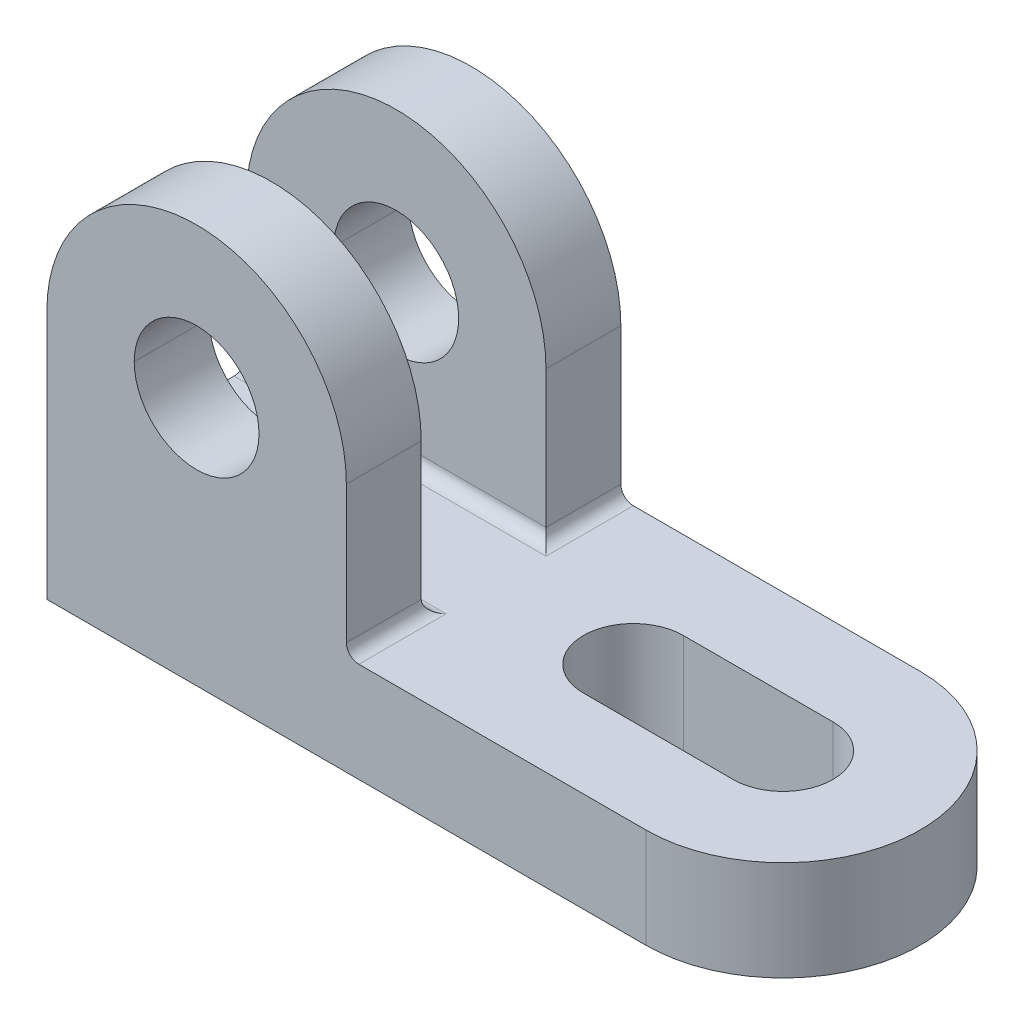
ISO-10303-21;
HEADER;
FILE_DESCRIPTION(('STEP AP214'),'2;1');
FILE_NAME('part.step','',(''),(''),'','','');
FILE_SCHEMA(('AUTOMOTIVE_DESIGN { 1 0 10303 214 1 1 1 1 }'));
ENDSEC;
DATA;
#1=APPLICATION_CONTEXT('core data for automotive mechanical design processes');
#2=APPLICATION_PROTOCOL_DEFINITION('international standard','automotive_design',2000,#1);
#3=PRODUCT_CONTEXT('',#1,'mechanical');
#4=PRODUCT('Part','Part','',(#3));
#5=PRODUCT_RELATED_PRODUCT_CATEGORY('part','',(#4));
#6=PRODUCT_DEFINITION_FORMATION('','',#4);
#7=PRODUCT_DEFINITION_CONTEXT('part definition',#1,'design');
#8=PRODUCT_DEFINITION('design','',#6,#7);
#9=PRODUCT_DEFINITION_SHAPE('','',#8);
#10=(LENGTH_UNIT() NAMED_UNIT(*) SI_UNIT(.MILLI.,.METRE.));
#11=(NAMED_UNIT(*) PLANE_ANGLE_UNIT() SI_UNIT($,.RADIAN.));
#12=(NAMED_UNIT(*) SI_UNIT($,.STERADIAN.) SOLID_ANGLE_UNIT());
#13=UNCERTAINTY_MEASURE_WITH_UNIT(LENGTH_MEASURE(1.E-05),#10,'distance_accuracy_value','');
#14=(GEOMETRIC_REPRESENTATION_CONTEXT(3) GLOBAL_UNCERTAINTY_ASSIGNED_CONTEXT((#13)) GLOBAL_UNIT_ASSIGNED_CONTEXT((#10,
#11,#12)) REPRESENTATION_CONTEXT('',''));
#15=CARTESIAN_POINT('',(0.,0.,0.));
#16=DIRECTION('',(0.,0.,1.));
#17=DIRECTION('',(1.,0.,0.));
#18=AXIS2_PLACEMENT_3D('',#15,#16,#17);
#19=CARTESIAN_POINT('',(-9.,18.,-10.));
#20=DIRECTION('',(0.,0.,-1.));
#21=DIRECTION('',(-1.,0.,0.));
#22=AXIS2_PLACEMENT_3D('',#19,#20,#21);
#23=CYLINDRICAL_SURFACE('',#22,2.);
#24=CARTESIAN_POINT('',(-11.,18.,-10.));
#25=CARTESIAN_POINT('',(-11.,16.8284271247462,-10.));
#26=CARTESIAN_POINT('',(-10.1715728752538,16.,-9.17157287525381));
#27=CARTESIAN_POINT('',(-9.,16.,-8.));
#28=(BOUNDED_CURVE() B_SPLINE_CURVE(3,(#24,#25,#26,#27),.UNSPECIFIED.,.F.,
.F.) B_SPLINE_CURVE_WITH_KNOTS((4,4),(0.,1.5707963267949),
.UNSPECIFIED.) CURVE() GEOMETRIC_REPRESENTATION_ITEM() RATIONAL_B_SPLINE_CURVE((1.,
0.804737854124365,0.804737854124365,1.)) REPRESENTATION_ITEM(''));
#29=CARTESIAN_POINT('',(-11.,18.,-10.));
#30=VERTEX_POINT('',#29);
#31=CARTESIAN_POINT('',(-9.,16.,-8.));
#32=VERTEX_POINT('',#31);
#33=EDGE_CURVE('E9',#30,#32,#28,.T.);
#34=ORIENTED_EDGE('',*,*,#33,.T.);
#35=DIRECTION('',(0.,0.,1.));
#36=VECTOR('',#35,1.);
#37=CARTESIAN_POINT('',(-9.,16.,0.));
#38=LINE('',#37,#36);
#39=CARTESIAN_POINT('',(-9.,16.,-22.));
#40=VERTEX_POINT('',#39);
#41=EDGE_CURVE('E244',#40,#32,#38,.T.);
#42=ORIENTED_EDGE('',*,*,#41,.F.);
#43=CARTESIAN_POINT('',(-9.,18.,-22.));
#44=DIRECTION('',(0.,0.,1.));
#45=DIRECTION('',(-1.,0.,0.));
#46=AXIS2_PLACEMENT_3D('',#43,#44,#45);
#47=CIRCLE('',#46,2.);
#48=CARTESIAN_POINT('',(-11.,18.,-22.));
#49=VERTEX_POINT('',#48);
#50=EDGE_CURVE('E420',#49,#40,#47,.T.);
#51=ORIENTED_EDGE('',*,*,#50,.F.);
#52=DIRECTION('',(0.,0.,-1.));
#53=VECTOR('',#52,1.);
#54=CARTESIAN_POINT('',(-11.,18.,-10.));
#55=LINE('',#54,#53);
#56=EDGE_CURVE('E291',#30,#49,#55,.T.);
#57=ORIENTED_EDGE('',*,*,#56,.F.);
#58=EDGE_LOOP('',(#34,#42,#51,#57));
#59=FACE_BOUND('',#58,.T.);
#60=ADVANCED_FACE('F15',(#59),#23,.F.);
#61=CARTESIAN_POINT('',(0.,18.,-8.));
#62=DIRECTION('',(-1.,0.,0.));
#63=DIRECTION('',(0.,0.,1.));
#64=AXIS2_PLACEMENT_3D('',#61,#62,#63);
#65=CYLINDRICAL_SURFACE('',#64,2.);
#66=CARTESIAN_POINT('',(-59.,18.,-8.));
#67=DIRECTION('',(1.,0.,0.));
#68=DIRECTION('',(0.,0.,-1.));
#69=AXIS2_PLACEMENT_3D('',#66,#67,#68);
#70=CIRCLE('',#69,2.);
#71=CARTESIAN_POINT('',(-59.,16.,-8.));
#72=VERTEX_POINT('',#71);
#73=CARTESIAN_POINT('',(-59.,18.,-10.));
#74=VERTEX_POINT('',#73);
#75=EDGE_CURVE('E229',#72,#74,#70,.T.);
#76=ORIENTED_EDGE('',*,*,#75,.F.);
#77=DIRECTION('',(-1.,0.,0.));
#78=VECTOR('',#77,1.);
#79=CARTESIAN_POINT('',(0.,16.,-8.));
#80=LINE('',#79,#78);
#81=EDGE_CURVE('E250',#32,#72,#80,.T.);
#82=ORIENTED_EDGE('',*,*,#81,.F.);
#83=ORIENTED_EDGE('',*,*,#33,.F.);
#84=DIRECTION('',(1.,0.,0.));
#85=VECTOR('',#84,1.);
#86=CARTESIAN_POINT('',(0.,18.,-10.));
#87=LINE('',#86,#85);
#88=EDGE_CURVE('E200',#74,#30,#87,.T.);
#89=ORIENTED_EDGE('',*,*,#88,.F.);
#90=EDGE_LOOP('',(#76,#82,#83,#89));
#91=FACE_BOUND('',#90,.T.);
#92=ADVANCED_FACE('F446',(#91),#65,.F.);
#93=CARTESIAN_POINT('',(-9.,18.,0.));
#94=DIRECTION('',(0.,0.,-1.));
#95=DIRECTION('',(-1.,0.,0.));
#96=AXIS2_PLACEMENT_3D('',#93,#94,#95);
#97=CYLINDRICAL_SURFACE('',#96,2.);
#98=CARTESIAN_POINT('',(-9.,16.,8.));
#99=CARTESIAN_POINT('',(-10.1715728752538,16.,9.17157287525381));
#100=CARTESIAN_POINT('',(-11.,16.8284271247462,10.));
#101=CARTESIAN_POINT('',(-11.,18.,10.));
#102=(BOUNDED_CURVE() B_SPLINE_CURVE(3,(#98,#99,#100,#101),.UNSPECIFIED.,.F.,
.F.) B_SPLINE_CURVE_WITH_KNOTS((4,4),(4.71238898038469,6.28318530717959),
.UNSPECIFIED.) CURVE() GEOMETRIC_REPRESENTATION_ITEM() RATIONAL_B_SPLINE_CURVE((1.,
0.804737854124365,0.804737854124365,1.)) REPRESENTATION_ITEM(''));
#103=CARTESIAN_POINT('',(-9.,16.,8.));
#104=VERTEX_POINT('',#103);
#105=CARTESIAN_POINT('',(-11.,18.,10.));
#106=VERTEX_POINT('',#105);
#107=EDGE_CURVE('E27',#104,#106,#102,.T.);
#108=ORIENTED_EDGE('',*,*,#107,.T.);
#109=DIRECTION('',(0.,0.,-1.));
#110=VECTOR('',#109,1.);
#111=CARTESIAN_POINT('',(-11.,18.,10.));
#112=LINE('',#111,#110);
#113=CARTESIAN_POINT('',(-11.,18.,22.));
#114=VERTEX_POINT('',#113);
#115=EDGE_CURVE('E188',#114,#106,#112,.T.);
#116=ORIENTED_EDGE('',*,*,#115,.F.);
#117=CARTESIAN_POINT('',(-9.,18.,22.));
#118=DIRECTION('',(0.,0.,-1.));
#119=DIRECTION('',(-1.,0.,0.));
#120=AXIS2_PLACEMENT_3D('',#117,#118,#119);
#121=CIRCLE('',#120,2.);
#122=CARTESIAN_POINT('',(-9.,16.,22.));
#123=VERTEX_POINT('',#122);
#124=EDGE_CURVE('E373',#123,#114,#121,.T.);
#125=ORIENTED_EDGE('',*,*,#124,.F.);
#126=DIRECTION('',(0.,0.,1.));
#127=VECTOR('',#126,1.);
#128=CARTESIAN_POINT('',(-9.,16.,22.));
#129=LINE('',#128,#127);
#130=EDGE_CURVE('E193',#104,#123,#129,.T.);
#131=ORIENTED_EDGE('',*,*,#130,.F.);
#132=EDGE_LOOP('',(#108,#116,#125,#131));
#133=FACE_BOUND('',#132,.T.);
#134=ADVANCED_FACE('F189',(#133),#97,.F.);
#135=CARTESIAN_POINT('',(0.,18.,8.));
#136=DIRECTION('',(-1.,0.,0.));
#137=DIRECTION('',(0.,0.,1.));
#138=AXIS2_PLACEMENT_3D('',#135,#136,#137);
#139=CYLINDRICAL_SURFACE('',#138,2.);
#140=CARTESIAN_POINT('',(-59.,18.,8.));
#141=DIRECTION('',(1.,0.,0.));
#142=DIRECTION('',(0.,0.,-1.));
#143=AXIS2_PLACEMENT_3D('',#140,#141,#142);
#144=CIRCLE('',#143,2.);
#145=CARTESIAN_POINT('',(-59.,18.,10.));
#146=VERTEX_POINT('',#145);
#147=CARTESIAN_POINT('',(-59.,16.,8.));
#148=VERTEX_POINT('',#147);
#149=EDGE_CURVE('E205',#146,#148,#144,.T.);
#150=ORIENTED_EDGE('',*,*,#149,.F.);
#151=DIRECTION('',(-1.,0.,0.));
#152=VECTOR('',#151,1.);
#153=CARTESIAN_POINT('',(0.,18.,10.));
#154=LINE('',#153,#152);
#155=EDGE_CURVE('E196',#106,#146,#154,.T.);
#156=ORIENTED_EDGE('',*,*,#155,.F.);
#157=ORIENTED_EDGE('',*,*,#107,.F.);
#158=DIRECTION('',(1.,0.,0.));
#159=VECTOR('',#158,1.);
#160=CARTESIAN_POINT('',(0.,16.,8.));
#161=LINE('',#160,#159);
#162=EDGE_CURVE('E235',#148,#104,#161,.T.);
#163=ORIENTED_EDGE('',*,*,#162,.F.);
#164=EDGE_LOOP('',(#150,#156,#157,#163));
#165=FACE_BOUND('',#164,.T.);
#166=ADVANCED_FACE('F198',(#165),#139,.F.);
#167=CARTESIAN_POINT('',(0.,0.,-10.));
#168=DIRECTION('',(0.,0.,-1.));
#169=DIRECTION('',(0.,-1.,0.));
#170=AXIS2_PLACEMENT_3D('',#167,#168,#169);
#171=PLANE('',#170);
#172=CARTESIAN_POINT('',(-35.,40.,-10.));
#173=DIRECTION('',(0.,0.,1.));
#174=DIRECTION('',(1.,0.,0.));
#175=AXIS2_PLACEMENT_3D('',#172,#173,#174);
#176=CIRCLE('',#175,10.);
#177=CARTESIAN_POINT('',(-45.,40.,-10.));
#178=VERTEX_POINT('',#177);
#179=CARTESIAN_POINT('',(-25.,40.,-10.));
#180=VERTEX_POINT('',#179);
#181=EDGE_CURVE('E329',#178,#180,#176,.T.);
#182=ORIENTED_EDGE('',*,*,#181,.F.);
#183=CARTESIAN_POINT('',(-35.,40.,-10.));
#184=DIRECTION('',(0.,0.,1.));
#185=DIRECTION('',(1.,0.,0.));
#186=AXIS2_PLACEMENT_3D('',#183,#184,#185);
#187=CIRCLE('',#186,10.);
#188=EDGE_CURVE('E296',#180,#178,#187,.T.);
#189=ORIENTED_EDGE('',*,*,#188,.F.);
#190=EDGE_LOOP('',(#182,#189));
#191=FACE_BOUND('',#190,.T.);
#192=DIRECTION('',(0.,1.,0.));
#193=VECTOR('',#192,1.);
#194=CARTESIAN_POINT('',(-59.,0.,-10.));
#195=LINE('',#194,#193);
#196=CARTESIAN_POINT('',(-59.,40.,-10.));
#197=VERTEX_POINT('',#196);
#198=EDGE_CURVE('E234',#74,#197,#195,.T.);
#199=ORIENTED_EDGE('',*,*,#198,.F.);
#200=ORIENTED_EDGE('',*,*,#88,.T.);
#201=DIRECTION('',(0.,1.,0.));
#202=VECTOR('',#201,1.);
#203=CARTESIAN_POINT('',(-11.,0.,-10.));
#204=LINE('',#203,#202);
#205=CARTESIAN_POINT('',(-11.,40.,-10.));
#206=VERTEX_POINT('',#205);
#207=EDGE_CURVE('E209',#30,#206,#204,.T.);
#208=ORIENTED_EDGE('',*,*,#207,.T.);
#209=CARTESIAN_POINT('',(-35.,40.,-10.));
#210=DIRECTION('',(0.,0.,1.));
#211=DIRECTION('',(1.,0.,0.));
#212=AXIS2_PLACEMENT_3D('',#209,#210,#211);
#213=CIRCLE('',#212,24.);
#214=EDGE_CURVE('E37',#206,#197,#213,.T.);
#215=ORIENTED_EDGE('',*,*,#214,.T.);
#216=EDGE_LOOP('',(#199,#200,#208,#215));
#217=FACE_BOUND('',#216,.T.);
#218=ADVANCED_FACE('F453',(#191,#217),#171,.F.);
#219=CARTESIAN_POINT('',(-35.,40.,-10.));
#220=DIRECTION('',(0.,0.,-1.));
#221=DIRECTION('',(-1.,0.,0.));
#222=AXIS2_PLACEMENT_3D('',#219,#220,#221);
#223=CYLINDRICAL_SURFACE('',#222,10.);
#224=DIRECTION('',(0.,0.,-1.));
#225=VECTOR('',#224,1.);
#226=CARTESIAN_POINT('',(-25.,40.,-10.));
#227=LINE('',#226,#225);
#228=CARTESIAN_POINT('',(-25.,40.,-22.));
#229=VERTEX_POINT('',#228);
#230=EDGE_CURVE('E330',#180,#229,#227,.T.);
#231=ORIENTED_EDGE('',*,*,#230,.F.);
#232=ORIENTED_EDGE('',*,*,#188,.T.);
#233=DIRECTION('',(0.,0.,-1.));
#234=VECTOR('',#233,1.);
#235=CARTESIAN_POINT('',(-45.,40.,-10.));
#236=LINE('',#235,#234);
#237=CARTESIAN_POINT('',(-45.,40.,-22.));
#238=VERTEX_POINT('',#237);
#239=EDGE_CURVE('E345',#178,#238,#236,.T.);
#240=ORIENTED_EDGE('',*,*,#239,.T.);
#241=CARTESIAN_POINT('',(-35.,40.,-22.));
#242=DIRECTION('',(0.,0.,1.));
#243=DIRECTION('',(1.,0.,0.));
#244=AXIS2_PLACEMENT_3D('',#241,#242,#243);
#245=CIRCLE('',#244,10.);
#246=EDGE_CURVE('E423',#229,#238,#245,.T.);
#247=ORIENTED_EDGE('',*,*,#246,.F.);
#248=EDGE_LOOP('',(#231,#232,#240,#247));
#249=FACE_BOUND('',#248,.T.);
#250=ADVANCED_FACE('F539',(#249),#223,.F.);
#251=CARTESIAN_POINT('',(-35.,40.,-10.));
#252=DIRECTION('',(0.,0.,-1.));
#253=DIRECTION('',(-1.,0.,0.));
#254=AXIS2_PLACEMENT_3D('',#251,#252,#253);
#255=CYLINDRICAL_SURFACE('',#254,24.);
#256=CARTESIAN_POINT('',(-35.,40.,-22.));
#257=DIRECTION('',(0.,0.,1.));
#258=DIRECTION('',(1.,0.,0.));
#259=AXIS2_PLACEMENT_3D('',#256,#257,#258);
#260=CIRCLE('',#259,24.);
#261=CARTESIAN_POINT('',(-11.,40.,-22.));
#262=VERTEX_POINT('',#261);
#263=CARTESIAN_POINT('',(-59.,40.,-22.));
#264=VERTEX_POINT('',#263);
#265=EDGE_CURVE('E407',#262,#264,#260,.T.);
#266=ORIENTED_EDGE('',*,*,#265,.T.);
#267=DIRECTION('',(0.,0.,-1.));
#268=VECTOR('',#267,1.);
#269=CARTESIAN_POINT('',(-59.,40.,-10.));
#270=LINE('',#269,#268);
#271=EDGE_CURVE('E233',#197,#264,#270,.T.);
#272=ORIENTED_EDGE('',*,*,#271,.F.);
#273=ORIENTED_EDGE('',*,*,#214,.F.);
#274=DIRECTION('',(0.,0.,-1.));
#275=VECTOR('',#274,1.);
#276=CARTESIAN_POINT('',(-11.,40.,-10.));
#277=LINE('',#276,#275);
#278=EDGE_CURVE('E293',#206,#262,#277,.T.);
#279=ORIENTED_EDGE('',*,*,#278,.T.);
#280=EDGE_LOOP('',(#266,#272,#273,#279));
#281=FACE_BOUND('',#280,.T.);
#282=ADVANCED_FACE('F451',(#281),#255,.T.);
#283=CARTESIAN_POINT('',(-11.,0.,-10.));
#284=DIRECTION('',(-1.,0.,0.));
#285=DIRECTION('',(0.,1.,0.));
#286=AXIS2_PLACEMENT_3D('',#283,#284,#285);
#287=PLANE('',#286);
#288=ORIENTED_EDGE('',*,*,#207,.F.);
#289=ORIENTED_EDGE('',*,*,#56,.T.);
#290=DIRECTION('',(0.,1.,0.));
#291=VECTOR('',#290,1.);
#292=CARTESIAN_POINT('',(-11.,0.,-22.));
#293=LINE('',#292,#291);
#294=EDGE_CURVE('E412',#49,#262,#293,.T.);
#295=ORIENTED_EDGE('',*,*,#294,.T.);
#296=ORIENTED_EDGE('',*,*,#278,.F.);
#297=EDGE_LOOP('',(#288,#289,#295,#296));
#298=FACE_BOUND('',#297,.T.);
#299=ADVANCED_FACE('F527',(#298),#287,.F.);
#300=CARTESIAN_POINT('',(0.,0.,10.));
#301=DIRECTION('',(0.,0.,1.));
#302=DIRECTION('',(1.,0.,0.));
#303=AXIS2_PLACEMENT_3D('',#300,#301,#302);
#304=PLANE('',#303);
#305=CARTESIAN_POINT('',(-35.,40.,10.));
#306=DIRECTION('',(0.,0.,1.));
#307=DIRECTION('',(1.,0.,0.));
#308=AXIS2_PLACEMENT_3D('',#305,#306,#307);
#309=CIRCLE('',#308,10.);
#310=CARTESIAN_POINT('',(-25.,40.,10.));
#311=VERTEX_POINT('',#310);
#312=CARTESIAN_POINT('',(-45.,40.,10.));
#313=VERTEX_POINT('',#312);
#314=EDGE_CURVE('E219',#311,#313,#309,.T.);
#315=ORIENTED_EDGE('',*,*,#314,.T.);
#316=CARTESIAN_POINT('',(-35.,40.,10.));
#317=DIRECTION('',(0.,0.,1.));
#318=DIRECTION('',(1.,0.,0.));
#319=AXIS2_PLACEMENT_3D('',#316,#317,#318);
#320=CIRCLE('',#319,10.);
#321=EDGE_CURVE('E344',#313,#311,#320,.T.);
#322=ORIENTED_EDGE('',*,*,#321,.T.);
#323=EDGE_LOOP('',(#315,#322));
#324=FACE_BOUND('',#323,.T.);
#325=DIRECTION('',(0.,1.,0.));
#326=VECTOR('',#325,1.);
#327=CARTESIAN_POINT('',(-11.,0.,10.));
#328=LINE('',#327,#326);
#329=CARTESIAN_POINT('',(-11.,40.,10.));
#330=VERTEX_POINT('',#329);
#331=EDGE_CURVE('E176',#106,#330,#328,.T.);
#332=ORIENTED_EDGE('',*,*,#331,.F.);
#333=ORIENTED_EDGE('',*,*,#155,.T.);
#334=DIRECTION('',(0.,1.,0.));
#335=VECTOR('',#334,1.);
#336=CARTESIAN_POINT('',(-59.,0.,10.));
#337=LINE('',#336,#335);
#338=CARTESIAN_POINT('',(-59.,40.,10.));
#339=VERTEX_POINT('',#338);
#340=EDGE_CURVE('E340',#146,#339,#337,.T.);
#341=ORIENTED_EDGE('',*,*,#340,.T.);
#342=CARTESIAN_POINT('',(-35.,40.,10.));
#343=DIRECTION('',(0.,0.,1.));
#344=DIRECTION('',(1.,0.,0.));
#345=AXIS2_PLACEMENT_3D('',#342,#343,#344);
#346=CIRCLE('',#345,24.);
#347=EDGE_CURVE('E206',#330,#339,#346,.T.);
#348=ORIENTED_EDGE('',*,*,#347,.F.);
#349=EDGE_LOOP('',(#332,#333,#341,#348));
#350=FACE_BOUND('',#349,.T.);
#351=ADVANCED_FACE('F210',(#324,#350),#304,.F.);
#352=CARTESIAN_POINT('',(-11.,0.,10.));
#353=DIRECTION('',(1.,0.,0.));
#354=DIRECTION('',(0.,1.,0.));
#355=AXIS2_PLACEMENT_3D('',#352,#353,#354);
#356=PLANE('',#355);
#357=DIRECTION('',(0.,1.,0.));
#358=VECTOR('',#357,1.);
#359=CARTESIAN_POINT('',(-11.,0.,22.));
#360=LINE('',#359,#358);
#361=CARTESIAN_POINT('',(-11.,40.,22.));
#362=VERTEX_POINT('',#361);
#363=EDGE_CURVE('E218',#114,#362,#360,.T.);
#364=ORIENTED_EDGE('',*,*,#363,.F.);
#365=ORIENTED_EDGE('',*,*,#115,.T.);
#366=ORIENTED_EDGE('',*,*,#331,.T.);
#367=DIRECTION('',(0.,0.,1.));
#368=VECTOR('',#367,1.);
#369=CARTESIAN_POINT('',(-11.,40.,10.));
#370=LINE('',#369,#368);
#371=EDGE_CURVE('E284',#330,#362,#370,.T.);
#372=ORIENTED_EDGE('',*,*,#371,.T.);
#373=EDGE_LOOP('',(#364,#365,#366,#372));
#374=FACE_BOUND('',#373,.T.);
#375=ADVANCED_FACE('F215',(#374),#356,.T.);
#376=CARTESIAN_POINT('',(-35.,40.,10.));
#377=DIRECTION('',(0.,0.,1.));
#378=DIRECTION('',(1.,0.,0.));
#379=AXIS2_PLACEMENT_3D('',#376,#377,#378);
#380=CYLINDRICAL_SURFACE('',#379,10.);
#381=DIRECTION('',(0.,0.,1.));
#382=VECTOR('',#381,1.);
#383=CARTESIAN_POINT('',(-45.,40.,10.));
#384=LINE('',#383,#382);
#385=CARTESIAN_POINT('',(-45.,40.,22.));
#386=VERTEX_POINT('',#385);
#387=EDGE_CURVE('E355',#313,#386,#384,.T.);
#388=ORIENTED_EDGE('',*,*,#387,.F.);
#389=ORIENTED_EDGE('',*,*,#314,.F.);
#390=DIRECTION('',(0.,0.,1.));
#391=VECTOR('',#390,1.);
#392=CARTESIAN_POINT('',(-25.,40.,10.));
#393=LINE('',#392,#391);
#394=CARTESIAN_POINT('',(-25.,40.,22.));
#395=VERTEX_POINT('',#394);
#396=EDGE_CURVE('E360',#311,#395,#393,.T.);
#397=ORIENTED_EDGE('',*,*,#396,.T.);
#398=CARTESIAN_POINT('',(-35.,40.,22.));
#399=DIRECTION('',(0.,0.,1.));
#400=DIRECTION('',(1.,0.,0.));
#401=AXIS2_PLACEMENT_3D('',#398,#399,#400);
#402=CIRCLE('',#401,10.);
#403=EDGE_CURVE('E383',#395,#386,#402,.T.);
#404=ORIENTED_EDGE('',*,*,#403,.T.);
#405=EDGE_LOOP('',(#388,#389,#397,#404));
#406=FACE_BOUND('',#405,.T.);
#407=ADVANCED_FACE('F505',(#406),#380,.F.);
#408=CARTESIAN_POINT('',(-35.,40.,10.));
#409=DIRECTION('',(0.,0.,1.));
#410=DIRECTION('',(1.,0.,0.));
#411=AXIS2_PLACEMENT_3D('',#408,#409,#410);
#412=CYLINDRICAL_SURFACE('',#411,24.);
#413=CARTESIAN_POINT('',(-35.,40.,22.));
#414=DIRECTION('',(0.,0.,1.));
#415=DIRECTION('',(1.,0.,0.));
#416=AXIS2_PLACEMENT_3D('',#413,#414,#415);
#417=CIRCLE('',#416,24.);
#418=CARTESIAN_POINT('',(-59.,40.,22.));
#419=VERTEX_POINT('',#418);
#420=EDGE_CURVE('E376',#362,#419,#417,.T.);
#421=ORIENTED_EDGE('',*,*,#420,.F.);
#422=ORIENTED_EDGE('',*,*,#371,.F.);
#423=ORIENTED_EDGE('',*,*,#347,.T.);
#424=DIRECTION('',(0.,0.,1.));
#425=VECTOR('',#424,1.);
#426=CARTESIAN_POINT('',(-59.,40.,10.));
#427=LINE('',#426,#425);
#428=EDGE_CURVE('E331',#339,#419,#427,.T.);
#429=ORIENTED_EDGE('',*,*,#428,.T.);
#430=EDGE_LOOP('',(#421,#422,#423,#429));
#431=FACE_BOUND('',#430,.T.);
#432=ADVANCED_FACE('F541',(#431),#412,.T.);
#433=CARTESIAN_POINT('',(37.,0.,-8.));
#434=DIRECTION('',(0.,0.,-1.));
#435=DIRECTION('',(0.,-1.,0.));
#436=AXIS2_PLACEMENT_3D('',#433,#434,#435);
#437=PLANE('',#436);
#438=DIRECTION('',(-1.,0.,0.));
#439=VECTOR('',#438,1.);
#440=CARTESIAN_POINT('',(37.,16.,-8.));
#441=LINE('',#440,#439);
#442=CARTESIAN_POINT('',(37.,16.,-8.));
#443=VERTEX_POINT('',#442);
#444=CARTESIAN_POINT('',(13.,16.,-8.));
#445=VERTEX_POINT('',#444);
#446=EDGE_CURVE('E256',#443,#445,#441,.T.);
#447=ORIENTED_EDGE('',*,*,#446,.T.);
#448=DIRECTION('',(0.,1.,0.));
#449=VECTOR('',#448,1.);
#450=CARTESIAN_POINT('',(13.,0.,-8.));
#451=LINE('',#450,#449);
#452=CARTESIAN_POINT('',(13.,0.,-8.));
#453=VERTEX_POINT('',#452);
#454=EDGE_CURVE('E285',#453,#445,#451,.T.);
#455=ORIENTED_EDGE('',*,*,#454,.F.);
#456=DIRECTION('',(-1.,0.,0.));
#457=VECTOR('',#456,1.);
#458=CARTESIAN_POINT('',(37.,0.,-8.));
#459=LINE('',#458,#457);
#460=CARTESIAN_POINT('',(37.,0.,-8.));
#461=VERTEX_POINT('',#460);
#462=EDGE_CURVE('E278',#461,#453,#459,.T.);
#463=ORIENTED_EDGE('',*,*,#462,.F.);
#464=DIRECTION('',(0.,1.,0.));
#465=VECTOR('',#464,1.);
#466=CARTESIAN_POINT('',(37.,0.,-8.));
#467=LINE('',#466,#465);
#468=EDGE_CURVE('E267',#461,#443,#467,.T.);
#469=ORIENTED_EDGE('',*,*,#468,.T.);
#470=EDGE_LOOP('',(#447,#455,#463,#469));
#471=FACE_BOUND('',#470,.T.);
#472=ADVANCED_FACE('F543',(#471),#437,.F.);
#473=CARTESIAN_POINT('',(13.,0.,0.));
#474=DIRECTION('',(0.,1.,0.));
#475=DIRECTION('',(0.,0.,1.));
#476=AXIS2_PLACEMENT_3D('',#473,#474,#475);
#477=CYLINDRICAL_SURFACE('',#476,8.);
#478=CARTESIAN_POINT('',(13.,16.,0.));
#479=DIRECTION('',(0.,1.,0.));
#480=DIRECTION('',(0.,0.,1.));
#481=AXIS2_PLACEMENT_3D('',#478,#479,#480);
#482=CIRCLE('',#481,8.);
#483=CARTESIAN_POINT('',(13.,16.,8.));
#484=VERTEX_POINT('',#483);
#485=EDGE_CURVE('E259',#445,#484,#482,.T.);
#486=ORIENTED_EDGE('',*,*,#485,.T.);
#487=DIRECTION('',(0.,1.,0.));
#488=VECTOR('',#487,1.);
#489=CARTESIAN_POINT('',(13.,0.,8.));
#490=LINE('',#489,#488);
#491=CARTESIAN_POINT('',(13.,0.,8.));
#492=VERTEX_POINT('',#491);
#493=EDGE_CURVE('E269',#492,#484,#490,.T.);
#494=ORIENTED_EDGE('',*,*,#493,.F.);
#495=CARTESIAN_POINT('',(13.,0.,0.));
#496=DIRECTION('',(0.,1.,0.));
#497=DIRECTION('',(0.,0.,1.));
#498=AXIS2_PLACEMENT_3D('',#495,#496,#497);
#499=CIRCLE('',#498,8.);
#500=EDGE_CURVE('E279',#453,#492,#499,.T.);
#501=ORIENTED_EDGE('',*,*,#500,.F.);
#502=ORIENTED_EDGE('',*,*,#454,.T.);
#503=EDGE_LOOP('',(#486,#494,#501,#502));
#504=FACE_BOUND('',#503,.T.);
#505=ADVANCED_FACE('F553',(#504),#477,.F.);
#506=CARTESIAN_POINT('',(37.,0.,8.));
#507=DIRECTION('',(0.,0.,1.));
#508=DIRECTION('',(1.,0.,0.));
#509=AXIS2_PLACEMENT_3D('',#506,#507,#508);
#510=PLANE('',#509);
#511=DIRECTION('',(1.,0.,0.));
#512=VECTOR('',#511,1.);
#513=CARTESIAN_POINT('',(37.,16.,8.));
#514=LINE('',#513,#512);
#515=CARTESIAN_POINT('',(37.,16.,8.));
#516=VERTEX_POINT('',#515);
#517=EDGE_CURVE('E252',#484,#516,#514,.T.);
#518=ORIENTED_EDGE('',*,*,#517,.T.);
#519=DIRECTION('',(0.,1.,0.));
#520=VECTOR('',#519,1.);
#521=CARTESIAN_POINT('',(37.,0.,8.));
#522=LINE('',#521,#520);
#523=CARTESIAN_POINT('',(37.,0.,8.));
#524=VERTEX_POINT('',#523);
#525=EDGE_CURVE('E263',#524,#516,#522,.T.);
#526=ORIENTED_EDGE('',*,*,#525,.F.);
#527=DIRECTION('',(1.,0.,0.));
#528=VECTOR('',#527,1.);
#529=CARTESIAN_POINT('',(37.,0.,8.));
#530=LINE('',#529,#528);
#531=EDGE_CURVE('E262',#492,#524,#530,.T.);
#532=ORIENTED_EDGE('',*,*,#531,.F.);
#533=ORIENTED_EDGE('',*,*,#493,.T.);
#534=EDGE_LOOP('',(#518,#526,#532,#533));
#535=FACE_BOUND('',#534,.T.);
#536=ADVANCED_FACE('F548',(#535),#510,.F.);
#537=CARTESIAN_POINT('',(37.,0.,0.));
#538=DIRECTION('',(0.,1.,0.));
#539=DIRECTION('',(0.,0.,1.));
#540=AXIS2_PLACEMENT_3D('',#537,#538,#539);
#541=CYLINDRICAL_SURFACE('',#540,8.);
#542=CARTESIAN_POINT('',(37.,16.,0.));
#543=DIRECTION('',(0.,1.,0.));
#544=DIRECTION('',(0.,0.,1.));
#545=AXIS2_PLACEMENT_3D('',#542,#543,#544);
#546=CIRCLE('',#545,8.);
#547=EDGE_CURVE('E248',#516,#443,#546,.T.);
#548=ORIENTED_EDGE('',*,*,#547,.T.);
#549=ORIENTED_EDGE('',*,*,#468,.F.);
#550=CARTESIAN_POINT('',(37.,0.,0.));
#551=DIRECTION('',(0.,1.,0.));
#552=DIRECTION('',(0.,0.,1.));
#553=AXIS2_PLACEMENT_3D('',#550,#551,#552);
#554=CIRCLE('',#553,8.);
#555=EDGE_CURVE('E272',#524,#461,#554,.T.);
#556=ORIENTED_EDGE('',*,*,#555,.F.);
#557=ORIENTED_EDGE('',*,*,#525,.T.);
#558=EDGE_LOOP('',(#548,#549,#556,#557));
#559=FACE_BOUND('',#558,.T.);
#560=ADVANCED_FACE('F551',(#559),#541,.F.);
#561=CARTESIAN_POINT('',(0.,0.,0.));
#562=DIRECTION('',(0.,1.,0.));
#563=DIRECTION('',(1.,0.,0.));
#564=AXIS2_PLACEMENT_3D('',#561,#562,#563);
#565=PLANE('',#564);
#566=ORIENTED_EDGE('',*,*,#531,.T.);
#567=ORIENTED_EDGE('',*,*,#555,.T.);
#568=ORIENTED_EDGE('',*,*,#462,.T.);
#569=ORIENTED_EDGE('',*,*,#500,.T.);
#570=EDGE_LOOP('',(#566,#567,#568,#569));
#571=FACE_BOUND('',#570,.T.);
#572=DIRECTION('',(1.,0.,0.));
#573=VECTOR('',#572,1.);
#574=CARTESIAN_POINT('',(0.,0.,22.));
#575=LINE('',#574,#573);
#576=CARTESIAN_POINT('',(-59.,0.,22.));
#577=VERTEX_POINT('',#576);
#578=CARTESIAN_POINT('',(37.,0.,22.));
#579=VERTEX_POINT('',#578);
#580=EDGE_CURVE('E367',#577,#579,#575,.T.);
#581=ORIENTED_EDGE('',*,*,#580,.F.);
#582=DIRECTION('',(0.,0.,1.));
#583=VECTOR('',#582,1.);
#584=CARTESIAN_POINT('',(-59.,0.,0.));
#585=LINE('',#584,#583);
#586=CARTESIAN_POINT('',(-59.,0.,-22.));
#587=VERTEX_POINT('',#586);
#588=EDGE_CURVE('E336',#587,#577,#585,.T.);
#589=ORIENTED_EDGE('',*,*,#588,.F.);
#590=DIRECTION('',(1.,0.,0.));
#591=VECTOR('',#590,1.);
#592=CARTESIAN_POINT('',(0.,0.,-22.));
#593=LINE('',#592,#591);
#594=CARTESIAN_POINT('',(37.,0.,-22.));
#595=VERTEX_POINT('',#594);
#596=EDGE_CURVE('E405',#587,#595,#593,.T.);
#597=ORIENTED_EDGE('',*,*,#596,.T.);
#598=CARTESIAN_POINT('',(37.,0.,0.));
#599=DIRECTION('',(0.,1.,0.));
#600=DIRECTION('',(0.,0.,1.));
#601=AXIS2_PLACEMENT_3D('',#598,#599,#600);
#602=CIRCLE('',#601,22.);
#603=EDGE_CURVE('E389',#579,#595,#602,.T.);
#604=ORIENTED_EDGE('',*,*,#603,.F.);
#605=EDGE_LOOP('',(#581,#589,#597,#604));
#606=FACE_BOUND('',#605,.T.);
#607=ADVANCED_FACE('F463',(#571,#606),#565,.F.);
#608=CARTESIAN_POINT('',(0.,16.,0.));
#609=DIRECTION('',(0.,1.,0.));
#610=DIRECTION('',(1.,0.,0.));
#611=AXIS2_PLACEMENT_3D('',#608,#609,#610);
#612=PLANE('',#611);
#613=ORIENTED_EDGE('',*,*,#547,.F.);
#614=ORIENTED_EDGE('',*,*,#517,.F.);
#615=ORIENTED_EDGE('',*,*,#485,.F.);
#616=ORIENTED_EDGE('',*,*,#446,.F.);
#617=EDGE_LOOP('',(#613,#614,#615,#616));
#618=FACE_BOUND('',#617,.T.);
#619=ORIENTED_EDGE('',*,*,#162,.T.);
#620=ORIENTED_EDGE('',*,*,#130,.T.);
#621=DIRECTION('',(1.,0.,0.));
#622=VECTOR('',#621,1.);
#623=CARTESIAN_POINT('',(0.,16.,22.));
#624=LINE('',#623,#622);
#625=CARTESIAN_POINT('',(37.,16.,22.));
#626=VERTEX_POINT('',#625);
#627=EDGE_CURVE('E365',#123,#626,#624,.T.);
#628=ORIENTED_EDGE('',*,*,#627,.T.);
#629=CARTESIAN_POINT('',(37.,16.,0.));
#630=DIRECTION('',(0.,1.,0.));
#631=DIRECTION('',(0.,0.,1.));
#632=AXIS2_PLACEMENT_3D('',#629,#630,#631);
#633=CIRCLE('',#632,22.);
#634=CARTESIAN_POINT('',(37.,16.,-22.));
#635=VERTEX_POINT('',#634);
#636=EDGE_CURVE('E396',#626,#635,#633,.T.);
#637=ORIENTED_EDGE('',*,*,#636,.T.);
#638=DIRECTION('',(1.,0.,0.));
#639=VECTOR('',#638,1.);
#640=CARTESIAN_POINT('',(0.,16.,-22.));
#641=LINE('',#640,#639);
#642=EDGE_CURVE('E421',#40,#635,#641,.T.);
#643=ORIENTED_EDGE('',*,*,#642,.F.);
#644=ORIENTED_EDGE('',*,*,#41,.T.);
#645=ORIENTED_EDGE('',*,*,#81,.T.);
#646=DIRECTION('',(0.,0.,1.));
#647=VECTOR('',#646,1.);
#648=CARTESIAN_POINT('',(-59.,16.,0.));
#649=LINE('',#648,#647);
#650=EDGE_CURVE('E434',#72,#148,#649,.T.);
#651=ORIENTED_EDGE('',*,*,#650,.T.);
#652=EDGE_LOOP('',(#619,#620,#628,#637,#643,#644,#645,#651));
#653=FACE_BOUND('',#652,.T.);
#654=ADVANCED_FACE('F490',(#618,#653),#612,.T.);
#655=CARTESIAN_POINT('',(-59.,16.,0.));
#656=DIRECTION('',(1.,0.,0.));
#657=DIRECTION('',(0.,0.,-1.));
#658=AXIS2_PLACEMENT_3D('',#655,#656,#657);
#659=PLANE('',#658);
#660=ORIENTED_EDGE('',*,*,#588,.T.);
#661=DIRECTION('',(0.,-1.,0.));
#662=VECTOR('',#661,1.);
#663=CARTESIAN_POINT('',(-59.,16.,22.));
#664=LINE('',#663,#662);
#665=EDGE_CURVE('E382',#419,#577,#664,.T.);
#666=ORIENTED_EDGE('',*,*,#665,.F.);
#667=ORIENTED_EDGE('',*,*,#428,.F.);
#668=ORIENTED_EDGE('',*,*,#340,.F.);
#669=ORIENTED_EDGE('',*,*,#149,.T.);
#670=ORIENTED_EDGE('',*,*,#650,.F.);
#671=ORIENTED_EDGE('',*,*,#75,.T.);
#672=ORIENTED_EDGE('',*,*,#198,.T.);
#673=ORIENTED_EDGE('',*,*,#271,.T.);
#674=DIRECTION('',(0.,-1.,0.));
#675=VECTOR('',#674,1.);
#676=CARTESIAN_POINT('',(-59.,16.,-22.));
#677=LINE('',#676,#675);
#678=EDGE_CURVE('E404',#264,#587,#677,.T.);
#679=ORIENTED_EDGE('',*,*,#678,.T.);
#680=EDGE_LOOP('',(#660,#666,#667,#668,#669,#670,#671,#672,#673,#679));
#681=FACE_BOUND('',#680,.T.);
#682=ADVANCED_FACE('F449',(#681),#659,.F.);
#683=CARTESIAN_POINT('',(0.,16.,-22.));
#684=DIRECTION('',(0.,0.,-1.));
#685=DIRECTION('',(0.,-1.,0.));
#686=AXIS2_PLACEMENT_3D('',#683,#684,#685);
#687=PLANE('',#686);
#688=CARTESIAN_POINT('',(-35.,40.,-22.));
#689=DIRECTION('',(0.,0.,1.));
#690=DIRECTION('',(1.,0.,0.));
#691=AXIS2_PLACEMENT_3D('',#688,#689,#690);
#692=CIRCLE('',#691,10.);
#693=EDGE_CURVE('E332',#238,#229,#692,.T.);
#694=ORIENTED_EDGE('',*,*,#693,.T.);
#695=ORIENTED_EDGE('',*,*,#246,.T.);
#696=EDGE_LOOP('',(#694,#695));
#697=FACE_BOUND('',#696,.T.);
#698=ORIENTED_EDGE('',*,*,#596,.F.);
#699=ORIENTED_EDGE('',*,*,#678,.F.);
#700=ORIENTED_EDGE('',*,*,#265,.F.);
#701=ORIENTED_EDGE('',*,*,#294,.F.);
#702=ORIENTED_EDGE('',*,*,#50,.T.);
#703=ORIENTED_EDGE('',*,*,#642,.T.);
#704=DIRECTION('',(0.,-1.,0.));
#705=VECTOR('',#704,1.);
#706=CARTESIAN_POINT('',(37.,16.,-22.));
#707=LINE('',#706,#705);
#708=EDGE_CURVE('E395',#635,#595,#707,.T.);
#709=ORIENTED_EDGE('',*,*,#708,.T.);
#710=EDGE_LOOP('',(#698,#699,#700,#701,#702,#703,#709));
#711=FACE_BOUND('',#710,.T.);
#712=ADVANCED_FACE('F459',(#697,#711),#687,.T.);
#713=CARTESIAN_POINT('',(37.,16.,0.));
#714=DIRECTION('',(0.,-1.,0.));
#715=DIRECTION('',(0.,0.,-1.));
#716=AXIS2_PLACEMENT_3D('',#713,#714,#715);
#717=CYLINDRICAL_SURFACE('',#716,22.);
#718=ORIENTED_EDGE('',*,*,#603,.T.);
#719=ORIENTED_EDGE('',*,*,#708,.F.);
#720=ORIENTED_EDGE('',*,*,#636,.F.);
#721=DIRECTION('',(0.,-1.,0.));
#722=VECTOR('',#721,1.);
#723=CARTESIAN_POINT('',(37.,16.,22.));
#724=LINE('',#723,#722);
#725=EDGE_CURVE('E361',#626,#579,#724,.T.);
#726=ORIENTED_EDGE('',*,*,#725,.T.);
#727=EDGE_LOOP('',(#718,#719,#720,#726));
#728=FACE_BOUND('',#727,.T.);
#729=ADVANCED_FACE('F510',(#728),#717,.T.);
#730=CARTESIAN_POINT('',(0.,16.,22.));
#731=DIRECTION('',(0.,0.,-1.));
#732=DIRECTION('',(0.,-1.,0.));
#733=AXIS2_PLACEMENT_3D('',#730,#731,#732);
#734=PLANE('',#733);
#735=ORIENTED_EDGE('',*,*,#403,.F.);
#736=CARTESIAN_POINT('',(-35.,40.,22.));
#737=DIRECTION('',(0.,0.,1.));
#738=DIRECTION('',(1.,0.,0.));
#739=AXIS2_PLACEMENT_3D('',#736,#737,#738);
#740=CIRCLE('',#739,10.);
#741=EDGE_CURVE('E352',#386,#395,#740,.T.);
#742=ORIENTED_EDGE('',*,*,#741,.F.);
#743=EDGE_LOOP('',(#735,#742));
#744=FACE_BOUND('',#743,.T.);
#745=ORIENTED_EDGE('',*,*,#580,.T.);
#746=ORIENTED_EDGE('',*,*,#725,.F.);
#747=ORIENTED_EDGE('',*,*,#627,.F.);
#748=ORIENTED_EDGE('',*,*,#124,.T.);
#749=ORIENTED_EDGE('',*,*,#363,.T.);
#750=ORIENTED_EDGE('',*,*,#420,.T.);
#751=ORIENTED_EDGE('',*,*,#665,.T.);
#752=EDGE_LOOP('',(#745,#746,#747,#748,#749,#750,#751));
#753=FACE_BOUND('',#752,.T.);
#754=ADVANCED_FACE('F466',(#744,#753),#734,.F.);
#755=CARTESIAN_POINT('',(-35.,40.,10.));
#756=DIRECTION('',(0.,0.,1.));
#757=DIRECTION('',(1.,0.,0.));
#758=AXIS2_PLACEMENT_3D('',#755,#756,#757);
#759=CYLINDRICAL_SURFACE('',#758,10.);
#760=ORIENTED_EDGE('',*,*,#321,.F.);
#761=ORIENTED_EDGE('',*,*,#387,.T.);
#762=ORIENTED_EDGE('',*,*,#741,.T.);
#763=ORIENTED_EDGE('',*,*,#396,.F.);
#764=EDGE_LOOP('',(#760,#761,#762,#763));
#765=FACE_BOUND('',#764,.T.);
#766=ADVANCED_FACE('F508',(#765),#759,.F.);
#767=CARTESIAN_POINT('',(-35.,40.,-10.));
#768=DIRECTION('',(0.,0.,-1.));
#769=DIRECTION('',(-1.,0.,0.));
#770=AXIS2_PLACEMENT_3D('',#767,#768,#769);
#771=CYLINDRICAL_SURFACE('',#770,10.);
#772=ORIENTED_EDGE('',*,*,#181,.T.);
#773=ORIENTED_EDGE('',*,*,#230,.T.);
#774=ORIENTED_EDGE('',*,*,#693,.F.);
#775=ORIENTED_EDGE('',*,*,#239,.F.);
#776=EDGE_LOOP('',(#772,#773,#774,#775));
#777=FACE_BOUND('',#776,.T.);
#778=ADVANCED_FACE('F518',(#777),#771,.F.);
#779=CLOSED_SHELL('',(#60,#92,#134,#166,#218,#250,#282,#299,#351,#375,#407,#432,#472,#505,#536,
#560,#607,#654,#682,#712,#729,#754,#766,#778));
#780=MANIFOLD_SOLID_BREP('B1',#779);
#781=ADVANCED_BREP_SHAPE_REPRESENTATION('',(#18,#780),#14);
#782=SHAPE_DEFINITION_REPRESENTATION(#9,#781);
ENDSEC;
END-ISO-10303-21;
